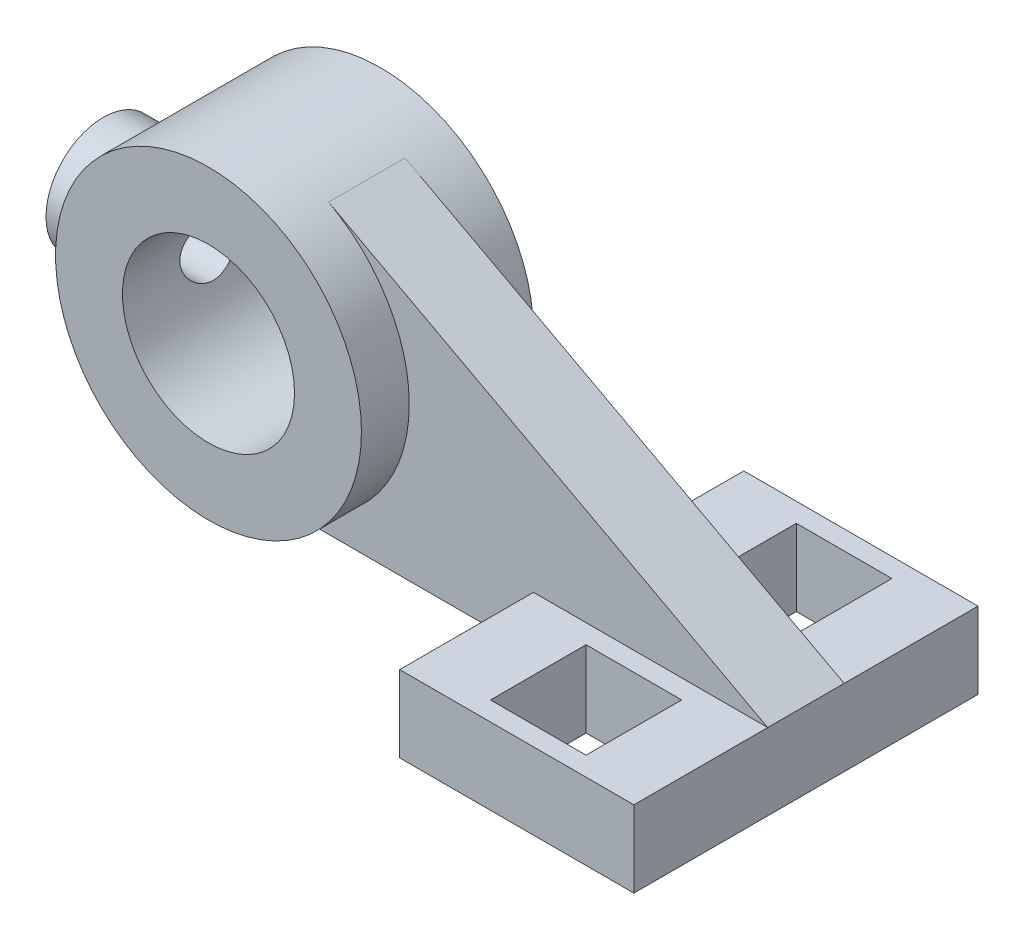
ISO-10303-21;
HEADER;
FILE_DESCRIPTION(('STEP AP214'),'2;1');
FILE_NAME('part.step','',(''),(''),'','','');
FILE_SCHEMA(('AUTOMOTIVE_DESIGN { 1 0 10303 214 1 1 1 1 }'));
ENDSEC;
DATA;
#1=APPLICATION_CONTEXT('core data for automotive mechanical design processes');
#2=APPLICATION_PROTOCOL_DEFINITION('international standard','automotive_design',2000,#1);
#3=PRODUCT_CONTEXT('',#1,'mechanical');
#4=PRODUCT('Part','Part','',(#3));
#5=PRODUCT_RELATED_PRODUCT_CATEGORY('part','',(#4));
#6=PRODUCT_DEFINITION_FORMATION('','',#4);
#7=PRODUCT_DEFINITION_CONTEXT('part definition',#1,'design');
#8=PRODUCT_DEFINITION('design','',#6,#7);
#9=PRODUCT_DEFINITION_SHAPE('','',#8);
#10=(LENGTH_UNIT() NAMED_UNIT(*) SI_UNIT(.MILLI.,.METRE.));
#11=(NAMED_UNIT(*) PLANE_ANGLE_UNIT() SI_UNIT($,.RADIAN.));
#12=(NAMED_UNIT(*) SI_UNIT($,.STERADIAN.) SOLID_ANGLE_UNIT());
#13=UNCERTAINTY_MEASURE_WITH_UNIT(LENGTH_MEASURE(1.E-05),#10,'distance_accuracy_value','');
#14=(GEOMETRIC_REPRESENTATION_CONTEXT(3) GLOBAL_UNCERTAINTY_ASSIGNED_CONTEXT((#13)) GLOBAL_UNIT_ASSIGNED_CONTEXT((#10,
#11,#12)) REPRESENTATION_CONTEXT('',''));
#15=CARTESIAN_POINT('',(0.,0.,0.));
#16=DIRECTION('',(0.,0.,1.));
#17=DIRECTION('',(1.,0.,0.));
#18=AXIS2_PLACEMENT_3D('',#15,#16,#17);
#19=CARTESIAN_POINT('',(0.,0.,-36.));
#20=DIRECTION('',(0.,0.,1.));
#21=DIRECTION('',(1.,0.,0.));
#22=AXIS2_PLACEMENT_3D('',#19,#20,#21);
#23=CYLINDRICAL_SURFACE('',#22,64.);
#24=DIRECTION('',(0.,0.,1.));
#25=VECTOR('',#24,1.);
#26=CARTESIAN_POINT('',(30.2468964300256,56.4014650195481,-16.));
#27=LINE('',#26,#25);
#28=CARTESIAN_POINT('',(30.2468964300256,56.4014650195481,-16.));
#29=VERTEX_POINT('',#28);
#30=CARTESIAN_POINT('',(30.2468964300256,56.4014650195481,16.));
#31=VERTEX_POINT('',#30);
#32=EDGE_CURVE('E286',#29,#31,#27,.T.);
#33=ORIENTED_EDGE('',*,*,#32,.F.);
#34=CARTESIAN_POINT('',(0.,0.,-16.));
#35=DIRECTION('',(0.,0.,1.));
#36=DIRECTION('',(1.,0.,0.));
#37=AXIS2_PLACEMENT_3D('',#34,#35,#36);
#38=CIRCLE('',#37,64.);
#39=CARTESIAN_POINT('',(0.,-64.,-16.));
#40=VERTEX_POINT('',#39);
#41=EDGE_CURVE('E273',#40,#29,#38,.T.);
#42=ORIENTED_EDGE('',*,*,#41,.F.);
#43=DIRECTION('',(0.,0.,1.));
#44=VECTOR('',#43,1.);
#45=CARTESIAN_POINT('',(0.,-64.,-16.));
#46=LINE('',#45,#44);
#47=CARTESIAN_POINT('',(0.,-64.,16.));
#48=VERTEX_POINT('',#47);
#49=EDGE_CURVE('E285',#40,#48,#46,.T.);
#50=ORIENTED_EDGE('',*,*,#49,.T.);
#51=CARTESIAN_POINT('',(0.,0.,16.));
#52=DIRECTION('',(0.,0.,1.));
#53=DIRECTION('',(1.,0.,0.));
#54=AXIS2_PLACEMENT_3D('',#51,#52,#53);
#55=CIRCLE('',#54,64.);
#56=EDGE_CURVE('E250',#48,#31,#55,.T.);
#57=ORIENTED_EDGE('',*,*,#56,.T.);
#58=EDGE_LOOP('',(#33,#42,#50,#57));
#59=FACE_BOUND('',#58,.T.);
#60=CARTESIAN_POINT('',(0.,0.,-36.));
#61=DIRECTION('',(0.,0.,1.));
#62=DIRECTION('',(1.,0.,0.));
#63=AXIS2_PLACEMENT_3D('',#60,#61,#62);
#64=CIRCLE('',#63,64.);
#65=CARTESIAN_POINT('',(64.,0.,-36.));
#66=VERTEX_POINT('',#65);
#67=EDGE_CURVE('E38',#66,#66,#64,.T.);
#68=ORIENTED_EDGE('',*,*,#67,.T.);
#69=EDGE_LOOP('',(#68));
#70=FACE_BOUND('',#69,.T.);
#71=CARTESIAN_POINT('',(0.,0.,36.));
#72=DIRECTION('',(0.,0.,1.));
#73=DIRECTION('',(1.,0.,0.));
#74=AXIS2_PLACEMENT_3D('',#71,#72,#73);
#75=CIRCLE('',#74,64.);
#76=CARTESIAN_POINT('',(64.,0.,36.));
#77=VERTEX_POINT('',#76);
#78=EDGE_CURVE('E289',#77,#77,#75,.T.);
#79=ORIENTED_EDGE('',*,*,#78,.F.);
#80=EDGE_LOOP('',(#79));
#81=FACE_BOUND('',#80,.T.);
#82=CARTESIAN_POINT('',(-64.,0.,24.));
#83=CARTESIAN_POINT('',(-64.0000022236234,0.64984837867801,24.0000030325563));
#84=CARTESIAN_POINT('',(-63.9900810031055,1.29965496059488,23.9735860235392));
#85=CARTESIAN_POINT('',(-63.9506736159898,2.59435422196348,23.8682021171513));
#86=CARTESIAN_POINT('',(-63.9211891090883,3.2392473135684,23.7892396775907));
#87=CARTESIAN_POINT('',(-63.8434575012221,4.51930130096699,23.5795783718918));
#88=CARTESIAN_POINT('',(-63.7952131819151,5.15446362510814,23.4488871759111));
#89=CARTESIAN_POINT('',(-63.6812460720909,6.41067087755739,23.1370298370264));
#90=CARTESIAN_POINT('',(-63.6155228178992,7.03171543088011,22.9558623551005));
#91=CARTESIAN_POINT('',(-63.4684606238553,8.25426356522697,22.5451139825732));
#92=CARTESIAN_POINT('',(-63.3871529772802,8.85580352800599,22.315630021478));
#93=CARTESIAN_POINT('',(-63.2109062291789,10.0368248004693,21.8099701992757));
#94=CARTESIAN_POINT('',(-63.1159672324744,10.6163062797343,21.5337946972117));
#95=CARTESIAN_POINT('',(-62.9147942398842,11.749899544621,20.9368167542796));
#96=CARTESIAN_POINT('',(-62.8085579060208,12.3040060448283,20.6160050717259));
#97=CARTESIAN_POINT('',(-62.5874011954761,13.3836065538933,19.9320720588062));
#98=CARTESIAN_POINT('',(-62.4724805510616,13.9090996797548,19.5689494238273));
#99=CARTESIAN_POINT('',(-62.2321872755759,14.9482428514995,18.7879843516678));
#100=CARTESIAN_POINT('',(-62.1065829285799,15.4606690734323,18.3685791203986));
#101=CARTESIAN_POINT('',(-61.9158652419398,16.2015667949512,17.7092802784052));
#102=CARTESIAN_POINT('',(-61.8519039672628,16.4439214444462,17.4844692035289));
#103=CARTESIAN_POINT('',(-61.7236005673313,16.9191521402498,17.0250268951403));
#104=CARTESIAN_POINT('',(-61.6592583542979,17.152025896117,16.7903933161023));
#105=CARTESIAN_POINT('',(-61.4662984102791,17.8358763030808,16.0722887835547));
#106=CARTESIAN_POINT('',(-61.3377437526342,18.27209601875,15.5746016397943));
#107=CARTESIAN_POINT('',(-61.0842731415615,19.1023575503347,14.5443329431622));
#108=CARTESIAN_POINT('',(-60.9593571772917,19.4963994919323,14.0117514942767));
#109=CARTESIAN_POINT('',(-60.7749758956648,20.0609950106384,13.1785755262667));
#110=CARTESIAN_POINT('',(-60.7129144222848,20.2479234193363,12.8895366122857));
#111=CARTESIAN_POINT('',(-60.5911823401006,20.6093416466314,12.3033967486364));
#112=CARTESIAN_POINT('',(-60.531511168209,20.7838344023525,12.0062977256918));
#113=CARTESIAN_POINT('',(-60.3567519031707,21.2882419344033,11.1034192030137));
#114=CARTESIAN_POINT('',(-60.2459078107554,21.5991170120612,10.4860124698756));
#115=CARTESIAN_POINT('',(-60.0392432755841,22.1671077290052,9.22483662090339));
#116=CARTESIAN_POINT('',(-59.9434181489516,22.4242401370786,8.5810758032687));
#117=CARTESIAN_POINT('',(-59.7700059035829,22.8824492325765,7.27149176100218));
#118=CARTESIAN_POINT('',(-59.6924177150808,23.0835292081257,6.60566983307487));
#119=CARTESIAN_POINT('',(-59.5610146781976,23.4204374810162,5.28474195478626));
#120=CARTESIAN_POINT('',(-59.5063556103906,23.5586029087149,4.63031574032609));
#121=CARTESIAN_POINT('',(-59.4182483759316,23.7799497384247,3.31080718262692));
#122=CARTESIAN_POINT('',(-59.3847996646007,23.8631325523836,2.64572511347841));
#123=CARTESIAN_POINT('',(-59.3403076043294,23.9735573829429,1.31042150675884));
#124=CARTESIAN_POINT('',(-59.3292562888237,24.0008192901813,0.640201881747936));
#125=CARTESIAN_POINT('',(-59.3299346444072,23.9991432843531,-0.70014224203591));
#126=CARTESIAN_POINT('',(-59.3416634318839,23.9702075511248,-1.37026674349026));
#127=CARTESIAN_POINT('',(-59.3860976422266,23.8598957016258,-2.66493143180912));
#128=CARTESIAN_POINT('',(-59.4175035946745,23.7817668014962,-3.28979632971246));
#129=CARTESIAN_POINT('',(-59.4990760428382,23.5769397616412,-4.53023644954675));
#130=CARTESIAN_POINT('',(-59.5492416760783,23.4502438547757,-5.1458120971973));
#131=CARTESIAN_POINT('',(-59.6668119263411,23.1494617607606,-6.36363778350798));
#132=CARTESIAN_POINT('',(-59.7342183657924,22.975370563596,-6.96588640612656));
#133=CARTESIAN_POINT('',(-59.8842902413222,22.5813237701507,-8.15322737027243));
#134=CARTESIAN_POINT('',(-59.966956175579,22.361366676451,-8.73831915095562));
#135=CARTESIAN_POINT('',(-60.1469084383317,21.8727779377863,-9.89875651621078));
#136=CARTESIAN_POINT('',(-60.2444412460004,21.603306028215,-10.4737097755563));
#137=CARTESIAN_POINT('',(-60.450227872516,21.0205939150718,-11.5989691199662));
#138=CARTESIAN_POINT('',(-60.558481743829,20.7073534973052,-12.149275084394));
#139=CARTESIAN_POINT('',(-60.7828686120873,20.0391395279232,-13.2224277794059));
#140=CARTESIAN_POINT('',(-60.8990038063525,19.6841543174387,-13.7452667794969));
#141=CARTESIAN_POINT('',(-61.1361960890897,18.9346233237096,-14.7606977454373));
#142=CARTESIAN_POINT('',(-61.2572533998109,18.5400757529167,-15.2532883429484));
#143=CARTESIAN_POINT('',(-61.444380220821,17.9064521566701,-15.9834987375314));
#144=CARTESIAN_POINT('',(-61.5097744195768,17.6806462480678,-16.2329260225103));
#145=CARTESIAN_POINT('',(-61.6406504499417,17.218821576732,-16.7219999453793));
#146=CARTESIAN_POINT('',(-61.7061322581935,16.9828051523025,-16.9616487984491));
#147=CARTESIAN_POINT('',(-61.9020789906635,16.2598224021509,-17.665518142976));
#148=CARTESIAN_POINT('',(-62.0320525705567,15.7578979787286,-18.1146897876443));
#149=CARTESIAN_POINT('',(-62.2871410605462,14.7173066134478,-18.9698340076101));
#150=CARTESIAN_POINT('',(-62.4122551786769,14.1786337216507,-19.3757995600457));
#151=CARTESIAN_POINT('',(-62.6542679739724,13.0677382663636,-20.1417308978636));
#152=CARTESIAN_POINT('',(-62.771166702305,12.4955159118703,-20.5016969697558));
#153=CARTESIAN_POINT('',(-62.9953108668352,11.3119031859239,-21.1781171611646));
#154=CARTESIAN_POINT('',(-63.1023780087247,10.7000422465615,-21.4938079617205));
#155=CARTESIAN_POINT('',(-63.3017326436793,9.44941953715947,-22.0722245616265));
#156=CARTESIAN_POINT('',(-63.3940198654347,8.81065727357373,-22.3349493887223));
#157=CARTESIAN_POINT('',(-63.5610990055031,7.51103971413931,-22.8048579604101));
#158=CARTESIAN_POINT('',(-63.6358972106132,6.85019245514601,-23.0120616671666));
#159=CARTESIAN_POINT('',(-63.7658089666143,5.51125014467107,-23.3689121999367));
#160=CARTESIAN_POINT('',(-63.8209236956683,4.83315612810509,-23.5185624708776));
#161=CARTESIAN_POINT('',(-63.9074336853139,3.5015928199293,-23.7522881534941));
#162=CARTESIAN_POINT('',(-63.9399345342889,2.84873186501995,-23.8394277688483));
#163=CARTESIAN_POINT('',(-63.9848951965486,1.53737555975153,-23.9597569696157));
#164=CARTESIAN_POINT('',(-63.9973557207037,0.878880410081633,-23.9929484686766));
#165=CARTESIAN_POINT('',(-64.0018868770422,-0.438545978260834,-24.005031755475));
#166=CARTESIAN_POINT('',(-63.9939614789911,-1.09747710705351,-23.9839341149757));
#167=CARTESIAN_POINT('',(-63.9579509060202,-2.4108155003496,-23.8876846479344));
#168=CARTESIAN_POINT('',(-63.9298660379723,-3.06522283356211,-23.8125336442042));
#169=CARTESIAN_POINT('',(-63.8557768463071,-4.33951159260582,-23.6128872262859));
#170=CARTESIAN_POINT('',(-63.8105040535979,-4.95975226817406,-23.4904029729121));
#171=CARTESIAN_POINT('',(-63.703198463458,-6.1872504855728,-23.1973291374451));
#172=CARTESIAN_POINT('',(-63.6411662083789,-6.79450844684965,-23.0267411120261));
#173=CARTESIAN_POINT('',(-63.501877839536,-7.99218660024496,-22.6389314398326));
#174=CARTESIAN_POINT('',(-63.4246204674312,-8.58260539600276,-22.4217059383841));
#175=CARTESIAN_POINT('',(-63.2567635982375,-9.74297593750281,-21.9423906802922));
#176=CARTESIAN_POINT('',(-63.166163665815,-10.3129270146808,-21.6802994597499));
#177=CARTESIAN_POINT('',(-62.9709524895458,-11.4454783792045,-21.10488644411));
#178=CARTESIAN_POINT('',(-62.8660080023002,-12.0073716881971,-20.7902865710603));
#179=CARTESIAN_POINT('',(-62.6468597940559,-13.1027859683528,-20.11790310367));
#180=CARTESIAN_POINT('',(-62.5326559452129,-13.6363065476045,-19.7601189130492));
#181=CARTESIAN_POINT('',(-62.2977417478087,-14.6722047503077,-19.0036294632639));
#182=CARTESIAN_POINT('',(-62.1770293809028,-15.1745726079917,-18.6049114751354));
#183=CARTESIAN_POINT('',(-61.9320377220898,-16.1453805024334,-17.7689876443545));
#184=CARTESIAN_POINT('',(-61.8077583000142,-16.6138192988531,-17.3317803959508));
#185=CARTESIAN_POINT('',(-61.6173494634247,-17.3021209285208,-16.6358470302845));
#186=CARTESIAN_POINT('',(-61.5513891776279,-17.5351849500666,-16.3899973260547));
#187=CARTESIAN_POINT('',(-61.4197961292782,-17.9906870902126,-15.8886707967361));
#188=CARTESIAN_POINT('',(-61.3541632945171,-18.2131276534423,-15.6331962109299));
#189=CARTESIAN_POINT('',(-61.1584051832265,-18.8641140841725,-14.8527473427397));
#190=CARTESIAN_POINT('',(-61.0294123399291,-19.2763531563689,-14.3137191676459));
#191=CARTESIAN_POINT('',(-60.7781975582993,-20.0543749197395,-13.2016189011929));
#192=CARTESIAN_POINT('',(-60.6559764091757,-20.4201522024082,-12.6285428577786));
#193=CARTESIAN_POINT('',(-60.4219419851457,-21.1025846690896,-11.4517877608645));
#194=CARTESIAN_POINT('',(-60.3101285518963,-21.4192406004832,-10.8481091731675));
#195=CARTESIAN_POINT('',(-60.0999638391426,-22.0020635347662,-9.61137164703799));
#196=CARTESIAN_POINT('',(-60.0016715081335,-22.2680112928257,-8.97819922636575));
#197=CARTESIAN_POINT('',(-59.8223729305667,-22.7453020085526,-7.68918286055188));
#198=CARTESIAN_POINT('',(-59.7413668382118,-22.956644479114,-7.03333871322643));
#199=CARTESIAN_POINT('',(-59.5995089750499,-23.3224583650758,-5.70419009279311));
#200=CARTESIAN_POINT('',(-59.5386467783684,-23.4769592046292,-5.03089484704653));
#201=CARTESIAN_POINT('',(-59.439244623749,-23.7275041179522,-3.67190024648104));
#202=CARTESIAN_POINT('',(-59.4007031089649,-23.8235522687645,-2.98620176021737));
#203=CARTESIAN_POINT('',(-59.349098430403,-23.9518039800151,-1.6524731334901));
#204=CARTESIAN_POINT('',(-59.3345571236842,-23.9877137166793,-1.00485404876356));
#205=CARTESIAN_POINT('',(-59.3267642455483,-24.006981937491,0.291279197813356));
#206=CARTESIAN_POINT('',(-59.3335117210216,-23.990342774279,0.9397933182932));
#207=CARTESIAN_POINT('',(-59.3680671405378,-23.904700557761,2.23271739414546));
#208=CARTESIAN_POINT('',(-59.3958731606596,-23.8357022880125,2.87712771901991));
#209=CARTESIAN_POINT('',(-59.471617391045,-23.6460804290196,4.15709647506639));
#210=CARTESIAN_POINT('',(-59.5195555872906,-23.5254568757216,4.79265491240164));
#211=CARTESIAN_POINT('',(-59.6322523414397,-23.2382758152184,6.03110100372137));
#212=CARTESIAN_POINT('',(-59.6964511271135,-23.0732373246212,6.63439321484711));
#213=CARTESIAN_POINT('',(-59.8404101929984,-22.697263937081,7.82455606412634));
#214=CARTESIAN_POINT('',(-59.9201700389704,-22.4863303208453,8.41142715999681));
#215=CARTESIAN_POINT('',(-60.0930239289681,-22.0202228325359,9.56541145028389));
#216=CARTESIAN_POINT('',(-60.1861204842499,-21.7650406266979,10.1325208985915));
#217=CARTESIAN_POINT('',(-60.3831318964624,-21.2123415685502,11.2437420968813));
#218=CARTESIAN_POINT('',(-60.4870472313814,-20.9148228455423,11.7878528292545));
#219=CARTESIAN_POINT('',(-60.7087125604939,-20.2626966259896,12.8781750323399));
#220=CARTESIAN_POINT('',(-60.8269022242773,-19.9059140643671,13.4230014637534));
#221=CARTESIAN_POINT('',(-61.0085171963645,-19.3390847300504,14.2163823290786));
#222=CARTESIAN_POINT('',(-61.0697809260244,-19.1448535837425,14.4768804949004));
#223=CARTESIAN_POINT('',(-61.1933720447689,-18.7460612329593,14.9896865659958));
#224=CARTESIAN_POINT('',(-61.2556996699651,-18.5414977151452,15.2419926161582));
#225=CARTESIAN_POINT('',(-61.4436640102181,-17.9127741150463,15.9860624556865));
#226=CARTESIAN_POINT('',(-61.5702859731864,-17.4735692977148,16.4649942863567));
#227=CARTESIAN_POINT('',(-61.8228826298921,-16.5576801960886,17.3857672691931));
#228=CARTESIAN_POINT('',(-61.9488573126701,-16.080995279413,17.8276077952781));
#229=CARTESIAN_POINT('',(-62.1383171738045,-15.3265039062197,18.4720237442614));
#230=CARTESIAN_POINT('',(-62.2031917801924,-15.0612046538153,18.6889697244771));
#231=CARTESIAN_POINT('',(-62.3314196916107,-14.5214008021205,19.1114198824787));
#232=CARTESIAN_POINT('',(-62.3947733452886,-14.2468983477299,19.3169266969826));
#233=CARTESIAN_POINT('',(-62.5819237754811,-13.4100462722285,19.9158515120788));
#234=CARTESIAN_POINT('',(-62.7028207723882,-12.8343095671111,20.2917100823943));
#235=CARTESIAN_POINT('',(-62.9334333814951,-11.651025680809,20.9934974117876));
#236=CARTESIAN_POINT('',(-63.0431477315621,-11.0434749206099,21.3194205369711));
#237=CARTESIAN_POINT('',(-63.2482858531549,-9.80056027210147,21.9185974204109));
#238=CARTESIAN_POINT('',(-63.3437093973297,-9.16519594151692,22.1918503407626));
#239=CARTESIAN_POINT('',(-63.5212618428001,-7.84303336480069,22.6937936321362));
#240=CARTESIAN_POINT('',(-63.602633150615,-7.15519978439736,22.9200325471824));
#241=CARTESIAN_POINT('',(-63.7441475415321,-5.75980882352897,23.3098555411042));
#242=CARTESIAN_POINT('',(-63.8042895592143,-5.05225045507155,23.4734364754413));
#243=CARTESIAN_POINT('',(-63.9013225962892,-3.6239597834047,23.73592039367));
#244=CARTESIAN_POINT('',(-63.9382233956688,-2.90323315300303,23.834850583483));
#245=CARTESIAN_POINT('',(-63.9875594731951,-1.45498637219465,23.9668849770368));
#246=CARTESIAN_POINT('',(-63.9999975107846,-0.727466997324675,23.9999966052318));
#247=CARTESIAN_POINT('',(-64.,0.,24.));
#248=B_SPLINE_CURVE_WITH_KNOTS('',3,(#82,#83,#84,#85,#86,#87,#88,#89,#90,#91,#92,#93,#94,#95,
#96,#97,#98,#99,#100,#101,#102,#103,#104,#105,#106,#107,#108,#109,#110,#111,#112,#113,#114,#115,
#116,#117,#118,#119,#120,#121,#122,#123,#124,#125,#126,#127,#128,#129,#130,#131,#132,#133,#134,
#135,#136,#137,#138,#139,#140,#141,#142,#143,#144,#145,#146,#147,#148,#149,#150,#151,#152,#153,
#154,#155,#156,#157,#158,#159,#160,#161,#162,#163,#164,#165,#166,#167,#168,#169,#170,#171,#172,
#173,#174,#175,#176,#177,#178,#179,#180,#181,#182,#183,#184,#185,#186,#187,#188,#189,#190,#191,
#192,#193,#194,#195,#196,#197,#198,#199,#200,#201,#202,#203,#204,#205,#206,#207,#208,#209,#210,
#211,#212,#213,#214,#215,#216,#217,#218,#219,#220,#221,#222,#223,#224,#225,#226,#227,#228,#229,
#230,#231,#232,#233,#234,#235,#236,#237,#238,#239,#240,#241,#242,#243,#244,#245,#246,#247),
.UNSPECIFIED.,.T.,.F.,(4,2,2,2,2,2,2,2,2,2,2,2,2,2,2,2,2,2,2,2,2,2,2,2,2,2,2,2,2,2,2,2,2,2,2,2,
2,2,2,2,2,2,2,2,2,2,2,2,2,2,2,2,2,2,2,2,2,2,2,2,2,2,2,2,2,2,2,2,2,2,2,2,2,2,2,2,2,2,2,2,2,2,4),
(0.,1.9488636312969,3.89756194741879,5.84597142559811,7.79443259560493,9.73902150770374,
11.6835954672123,13.6285726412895,15.5736098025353,17.5931192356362,18.6029830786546,
19.6130894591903,21.6332454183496,23.6533953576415,24.7024101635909,25.7511763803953,
27.8485406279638,29.9452494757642,32.0418353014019,34.0524685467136,36.0630501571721,
38.0729164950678,40.0827048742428,41.9720272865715,43.8612628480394,45.7506981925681,
47.6401952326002,49.5653516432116,51.4905174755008,53.4162222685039,55.3420141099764,
56.3700106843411,57.3977730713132,59.4531833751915,61.5089272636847,63.5646583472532,
65.6523435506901,67.7400670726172,69.8270389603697,71.9138859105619,73.8897475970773,
75.8655391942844,77.8409460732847,79.8163228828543,81.7156473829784,83.6149104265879,
85.5143305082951,87.4138125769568,89.3690567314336,91.3243278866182,93.2802089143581,
95.2361614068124,96.2712750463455,97.3061493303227,99.3757745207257,101.445640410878,
103.515474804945,105.594065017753,107.672673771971,109.75020501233,111.827591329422,
113.771479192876,115.715280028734,117.658903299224,119.602525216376,121.486654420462,
123.370731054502,125.255162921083,127.139678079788,129.122980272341,130.114745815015,
131.106734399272,133.090650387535,135.0745998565,136.120704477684,137.166566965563,
139.258122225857,141.34991328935,143.441737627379,145.624431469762,147.807234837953,
149.989119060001,152.170757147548),.UNSPECIFIED.);
#249=CARTESIAN_POINT('',(-64.,0.,24.));
#250=VERTEX_POINT('',#249);
#251=EDGE_CURVE('E171',#250,#250,#248,.T.);
#252=ORIENTED_EDGE('',*,*,#251,.F.);
#253=EDGE_LOOP('',(#252));
#254=FACE_BOUND('',#253,.T.);
#255=ADVANCED_FACE('F31',(#59,#70,#81,#254),#23,.T.);
#256=CARTESIAN_POINT('',(75.,-42.141384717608,-72.));
#257=DIRECTION('',(0.,1.,0.));
#258=DIRECTION('',(-1.,0.,0.));
#259=AXIS2_PLACEMENT_3D('',#256,#257,#258);
#260=PLANE('',#259);
#261=DIRECTION('',(-1.,0.,0.));
#262=VECTOR('',#261,1.);
#263=CARTESIAN_POINT('',(75.,-42.141384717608,-16.));
#264=LINE('',#263,#262);
#265=CARTESIAN_POINT('',(214.,-42.141384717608,-16.));
#266=VERTEX_POINT('',#265);
#267=CARTESIAN_POINT('',(116.,-42.141384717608,-16.));
#268=VERTEX_POINT('',#267);
#269=EDGE_CURVE('E281',#266,#268,#264,.T.);
#270=ORIENTED_EDGE('',*,*,#269,.F.);
#271=DIRECTION('',(0.,0.,1.));
#272=VECTOR('',#271,1.);
#273=CARTESIAN_POINT('',(214.,-42.141384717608,-72.));
#274=LINE('',#273,#272);
#275=CARTESIAN_POINT('',(214.,-42.141384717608,-72.));
#276=VERTEX_POINT('',#275);
#277=EDGE_CURVE('E255',#276,#266,#274,.T.);
#278=ORIENTED_EDGE('',*,*,#277,.F.);
#279=DIRECTION('',(-1.,0.,0.));
#280=VECTOR('',#279,1.);
#281=CARTESIAN_POINT('',(75.,-42.141384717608,-72.));
#282=LINE('',#281,#280);
#283=CARTESIAN_POINT('',(116.,-42.141384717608,-72.));
#284=VERTEX_POINT('',#283);
#285=EDGE_CURVE('E241',#276,#284,#282,.T.);
#286=ORIENTED_EDGE('',*,*,#285,.T.);
#287=DIRECTION('',(0.,0.,1.));
#288=VECTOR('',#287,1.);
#289=CARTESIAN_POINT('',(116.,-42.141384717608,-72.));
#290=LINE('',#289,#288);
#291=EDGE_CURVE('E251',#284,#268,#290,.T.);
#292=ORIENTED_EDGE('',*,*,#291,.T.);
#293=EDGE_LOOP('',(#270,#278,#286,#292));
#294=FACE_BOUND('',#293,.T.);
#295=DIRECTION('',(-1.,0.,0.));
#296=VECTOR('',#295,1.);
#297=CARTESIAN_POINT('',(146.,-42.141384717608,-24.));
#298=LINE('',#297,#296);
#299=CARTESIAN_POINT('',(186.,-42.141384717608,-24.));
#300=VERTEX_POINT('',#299);
#301=CARTESIAN_POINT('',(146.,-42.141384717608,-24.));
#302=VERTEX_POINT('',#301);
#303=EDGE_CURVE('E181',#300,#302,#298,.T.);
#304=ORIENTED_EDGE('',*,*,#303,.T.);
#305=DIRECTION('',(0.,0.,-1.));
#306=VECTOR('',#305,1.);
#307=CARTESIAN_POINT('',(146.,-42.141384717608,-24.));
#308=LINE('',#307,#306);
#309=CARTESIAN_POINT('',(146.,-42.141384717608,-64.));
#310=VERTEX_POINT('',#309);
#311=EDGE_CURVE('E45',#302,#310,#308,.T.);
#312=ORIENTED_EDGE('',*,*,#311,.T.);
#313=DIRECTION('',(1.,0.,0.));
#314=VECTOR('',#313,1.);
#315=CARTESIAN_POINT('',(146.,-42.141384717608,-64.));
#316=LINE('',#315,#314);
#317=CARTESIAN_POINT('',(186.,-42.141384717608,-64.));
#318=VERTEX_POINT('',#317);
#319=EDGE_CURVE('E165',#310,#318,#316,.T.);
#320=ORIENTED_EDGE('',*,*,#319,.T.);
#321=DIRECTION('',(0.,0.,1.));
#322=VECTOR('',#321,1.);
#323=CARTESIAN_POINT('',(186.,-42.141384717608,-24.));
#324=LINE('',#323,#322);
#325=EDGE_CURVE('E168',#318,#300,#324,.T.);
#326=ORIENTED_EDGE('',*,*,#325,.T.);
#327=EDGE_LOOP('',(#304,#312,#320,#326));
#328=FACE_BOUND('',#327,.T.);
#329=ADVANCED_FACE('F330',(#294,#328),#260,.T.);
#330=CARTESIAN_POINT('',(75.,-74.141384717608,-72.));
#331=DIRECTION('',(0.,-1.,0.));
#332=DIRECTION('',(0.,0.,-1.));
#333=AXIS2_PLACEMENT_3D('',#330,#331,#332);
#334=PLANE('',#333);
#335=DIRECTION('',(0.,0.,1.));
#336=VECTOR('',#335,1.);
#337=CARTESIAN_POINT('',(214.,-74.141384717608,-72.));
#338=LINE('',#337,#336);
#339=CARTESIAN_POINT('',(214.,-74.141384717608,-72.));
#340=VERTEX_POINT('',#339);
#341=CARTESIAN_POINT('',(214.,-74.141384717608,72.));
#342=VERTEX_POINT('',#341);
#343=EDGE_CURVE('E247',#340,#342,#338,.T.);
#344=ORIENTED_EDGE('',*,*,#343,.T.);
#345=DIRECTION('',(1.,0.,0.));
#346=VECTOR('',#345,1.);
#347=CARTESIAN_POINT('',(75.,-74.141384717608,72.));
#348=LINE('',#347,#346);
#349=CARTESIAN_POINT('',(116.,-74.141384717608,72.));
#350=VERTEX_POINT('',#349);
#351=EDGE_CURVE('E217',#350,#342,#348,.T.);
#352=ORIENTED_EDGE('',*,*,#351,.F.);
#353=DIRECTION('',(0.,0.,1.));
#354=VECTOR('',#353,1.);
#355=CARTESIAN_POINT('',(116.,-74.141384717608,-72.));
#356=LINE('',#355,#354);
#357=CARTESIAN_POINT('',(116.,-74.141384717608,-72.));
#358=VERTEX_POINT('',#357);
#359=EDGE_CURVE('E248',#358,#350,#356,.T.);
#360=ORIENTED_EDGE('',*,*,#359,.F.);
#361=DIRECTION('',(1.,0.,0.));
#362=VECTOR('',#361,1.);
#363=CARTESIAN_POINT('',(75.,-74.141384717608,-72.));
#364=LINE('',#363,#362);
#365=EDGE_CURVE('E235',#358,#340,#364,.T.);
#366=ORIENTED_EDGE('',*,*,#365,.T.);
#367=EDGE_LOOP('',(#344,#352,#360,#366));
#368=FACE_BOUND('',#367,.T.);
#369=DIRECTION('',(0.,0.,1.));
#370=VECTOR('',#369,1.);
#371=CARTESIAN_POINT('',(146.,-74.141384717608,24.));
#372=LINE('',#371,#370);
#373=CARTESIAN_POINT('',(146.,-74.141384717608,24.));
#374=VERTEX_POINT('',#373);
#375=CARTESIAN_POINT('',(146.,-74.141384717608,64.));
#376=VERTEX_POINT('',#375);
#377=EDGE_CURVE('E192',#374,#376,#372,.T.);
#378=ORIENTED_EDGE('',*,*,#377,.T.);
#379=DIRECTION('',(1.,0.,0.));
#380=VECTOR('',#379,1.);
#381=CARTESIAN_POINT('',(146.,-74.141384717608,64.));
#382=LINE('',#381,#380);
#383=CARTESIAN_POINT('',(186.,-74.141384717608,64.));
#384=VERTEX_POINT('',#383);
#385=EDGE_CURVE('E195',#376,#384,#382,.T.);
#386=ORIENTED_EDGE('',*,*,#385,.T.);
#387=DIRECTION('',(0.,0.,-1.));
#388=VECTOR('',#387,1.);
#389=CARTESIAN_POINT('',(186.,-74.141384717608,24.));
#390=LINE('',#389,#388);
#391=CARTESIAN_POINT('',(186.,-74.141384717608,24.));
#392=VERTEX_POINT('',#391);
#393=EDGE_CURVE('E199',#384,#392,#390,.T.);
#394=ORIENTED_EDGE('',*,*,#393,.T.);
#395=DIRECTION('',(-1.,0.,0.));
#396=VECTOR('',#395,1.);
#397=CARTESIAN_POINT('',(146.,-74.141384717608,24.));
#398=LINE('',#397,#396);
#399=EDGE_CURVE('E202',#392,#374,#398,.T.);
#400=ORIENTED_EDGE('',*,*,#399,.T.);
#401=EDGE_LOOP('',(#378,#386,#394,#400));
#402=FACE_BOUND('',#401,.T.);
#403=DIRECTION('',(1.,0.,0.));
#404=VECTOR('',#403,1.);
#405=CARTESIAN_POINT('',(146.,-74.141384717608,-64.));
#406=LINE('',#405,#404);
#407=CARTESIAN_POINT('',(146.,-74.141384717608,-64.));
#408=VERTEX_POINT('',#407);
#409=CARTESIAN_POINT('',(186.,-74.141384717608,-64.));
#410=VERTEX_POINT('',#409);
#411=EDGE_CURVE('E161',#408,#410,#406,.T.);
#412=ORIENTED_EDGE('',*,*,#411,.F.);
#413=DIRECTION('',(0.,0.,-1.));
#414=VECTOR('',#413,1.);
#415=CARTESIAN_POINT('',(146.,-74.141384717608,-24.));
#416=LINE('',#415,#414);
#417=CARTESIAN_POINT('',(146.,-74.141384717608,-24.));
#418=VERTEX_POINT('',#417);
#419=EDGE_CURVE('E157',#418,#408,#416,.T.);
#420=ORIENTED_EDGE('',*,*,#419,.F.);
#421=DIRECTION('',(-1.,0.,0.));
#422=VECTOR('',#421,1.);
#423=CARTESIAN_POINT('',(146.,-74.141384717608,-24.));
#424=LINE('',#423,#422);
#425=CARTESIAN_POINT('',(186.,-74.141384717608,-24.));
#426=VERTEX_POINT('',#425);
#427=EDGE_CURVE('E149',#426,#418,#424,.T.);
#428=ORIENTED_EDGE('',*,*,#427,.F.);
#429=DIRECTION('',(0.,0.,1.));
#430=VECTOR('',#429,1.);
#431=CARTESIAN_POINT('',(186.,-74.141384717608,-24.));
#432=LINE('',#431,#430);
#433=EDGE_CURVE('E156',#410,#426,#432,.T.);
#434=ORIENTED_EDGE('',*,*,#433,.F.);
#435=EDGE_LOOP('',(#412,#420,#428,#434));
#436=FACE_BOUND('',#435,.T.);
#437=ADVANCED_FACE('F164',(#368,#402,#436),#334,.T.);
#438=CARTESIAN_POINT('',(0.,0.,-36.));
#439=DIRECTION('',(0.,0.,1.));
#440=DIRECTION('',(1.,0.,0.));
#441=AXIS2_PLACEMENT_3D('',#438,#439,#440);
#442=CYLINDRICAL_SURFACE('',#441,36.);
#443=CARTESIAN_POINT('',(-36.,0.,12.));
#444=CARTESIAN_POINT('',(-36.0000000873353,-0.327380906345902,12.0000001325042));
#445=CARTESIAN_POINT('',(-35.9955240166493,-0.654759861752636,11.9865919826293));
#446=CARTESIAN_POINT('',(-35.9777430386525,-1.30708350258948,11.9330896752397));
#447=CARTESIAN_POINT('',(-35.964438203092,-1.63202820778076,11.8929957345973));
#448=CARTESIAN_POINT('',(-35.9293616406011,-2.27713334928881,11.7864986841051));
#449=CARTESIAN_POINT('',(-35.9075892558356,-2.59729341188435,11.7200935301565));
#450=CARTESIAN_POINT('',(-35.856165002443,-3.23053420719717,11.5615822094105));
#451=CARTESIAN_POINT('',(-35.8265130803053,-3.54361489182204,11.4694758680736));
#452=CARTESIAN_POINT('',(-35.7601741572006,-4.16003428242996,11.2605437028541));
#453=CARTESIAN_POINT('',(-35.72349930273,-4.46338876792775,11.1437605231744));
#454=CARTESIAN_POINT('',(-35.6440350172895,-5.05895574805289,10.8863315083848));
#455=CARTESIAN_POINT('',(-35.6012456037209,-5.35116827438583,10.7456857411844));
#456=CARTESIAN_POINT('',(-35.5106458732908,-5.92264610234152,10.4416007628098));
#457=CARTESIAN_POINT('',(-35.4628357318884,-6.20191185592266,10.2781623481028));
#458=CARTESIAN_POINT('',(-35.3633770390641,-6.74596768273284,9.92956922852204));
#459=CARTESIAN_POINT('',(-35.3117270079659,-7.01075210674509,9.74440613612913));
#460=CARTESIAN_POINT('',(-35.204260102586,-7.53213713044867,9.34759405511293));
#461=CARTESIAN_POINT('',(-35.1483638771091,-7.78823424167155,9.13530480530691));
#462=CARTESIAN_POINT('',(-35.0353296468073,-8.28189840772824,8.69026213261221));
#463=CARTESIAN_POINT('',(-34.9781910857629,-8.51945693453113,8.45749939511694));
#464=CARTESIAN_POINT('',(-34.8642061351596,-8.97452918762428,7.97297380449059));
#465=CARTESIAN_POINT('',(-34.8073598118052,-9.19203854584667,7.72120683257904));
#466=CARTESIAN_POINT('',(-34.6955377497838,-9.60549401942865,7.2003470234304));
#467=CARTESIAN_POINT('',(-34.6405611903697,-9.80144968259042,6.93126194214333));
#468=CARTESIAN_POINT('',(-34.532417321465,-10.1760145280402,6.36915226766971));
#469=CARTESIAN_POINT('',(-34.4793501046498,-10.3539478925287,6.07565744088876));
#470=CARTESIAN_POINT('',(-34.3784229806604,-10.6842812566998,5.47392758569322));
#471=CARTESIAN_POINT('',(-34.3305609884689,-10.8366914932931,5.16569853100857));
#472=CARTESIAN_POINT('',(-34.2415343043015,-11.1147947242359,4.53647920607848));
#473=CARTESIAN_POINT('',(-34.2003694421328,-11.2404883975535,4.2154892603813));
#474=CARTESIAN_POINT('',(-34.12609390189,-11.4640135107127,3.5630448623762));
#475=CARTESIAN_POINT('',(-34.0929828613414,-11.5618462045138,3.23159088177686));
#476=CARTESIAN_POINT('',(-34.0369075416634,-11.7258767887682,2.57203670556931));
#477=CARTESIAN_POINT('',(-34.013638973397,-11.7930294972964,2.24419978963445));
#478=CARTESIAN_POINT('',(-33.9764455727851,-11.8997627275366,1.58354061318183));
#479=CARTESIAN_POINT('',(-33.9625205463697,-11.9393438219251,1.25071845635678));
#480=CARTESIAN_POINT('',(-33.9444865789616,-11.9905200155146,0.582752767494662));
#481=CARTESIAN_POINT('',(-33.9403750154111,-12.0021225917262,0.247609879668));
#482=CARTESIAN_POINT('',(-33.942101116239,-11.9972406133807,-0.422440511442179));
#483=CARTESIAN_POINT('',(-33.9479384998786,-11.9807568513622,-0.757348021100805));
#484=CARTESIAN_POINT('',(-33.9688702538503,-11.9212742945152,-1.40901773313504));
#485=CARTESIAN_POINT('',(-33.9835287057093,-11.8795236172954,-1.72590885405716));
#486=CARTESIAN_POINT('',(-34.0212698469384,-11.7710022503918,-2.35485408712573));
#487=CARTESIAN_POINT('',(-34.0443522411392,-11.7042324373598,-2.66690836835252));
#488=CARTESIAN_POINT('',(-34.0982523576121,-11.5462608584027,-3.28410511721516));
#489=CARTESIAN_POINT('',(-34.129070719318,-11.4550570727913,-3.58924701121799));
#490=CARTESIAN_POINT('',(-34.1975465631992,-11.2489815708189,-4.19063918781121));
#491=CARTESIAN_POINT('',(-34.2352042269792,-11.1341092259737,-4.48688923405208));
#492=CARTESIAN_POINT('',(-34.3169468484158,-10.8795816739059,-5.07331151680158));
#493=CARTESIAN_POINT('',(-34.3611243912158,-10.7395618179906,-5.36331248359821));
#494=CARTESIAN_POINT('',(-34.4542334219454,-10.4369943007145,-5.93064479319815));
#495=CARTESIAN_POINT('',(-34.5031666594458,-10.2744383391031,-6.20797141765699));
#496=CARTESIAN_POINT('',(-34.6044509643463,-9.92796712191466,-6.748216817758));
#497=CARTESIAN_POINT('',(-34.6568014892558,-9.74405525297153,-7.011137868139));
#498=CARTESIAN_POINT('',(-34.7635909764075,-9.35592144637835,-7.52127040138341));
#499=CARTESIAN_POINT('',(-34.8180308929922,-9.1516901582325,-7.76847456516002));
#500=CARTESIAN_POINT('',(-34.9304644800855,-8.71301035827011,-8.25815187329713));
#501=CARTESIAN_POINT('',(-34.988495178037,-8.47754042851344,-8.49970248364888));
#502=CARTESIAN_POINT('',(-35.1036973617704,-7.98710487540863,-8.96212602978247));
#503=CARTESIAN_POINT('',(-35.1608691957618,-7.73214742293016,-9.18300754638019));
#504=CARTESIAN_POINT('',(-35.2728530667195,-7.20407593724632,-9.60287097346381));
#505=CARTESIAN_POINT('',(-35.3276638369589,-6.93095235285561,-9.80184121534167));
#506=CARTESIAN_POINT('',(-35.4333782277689,-6.36848094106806,-10.1762736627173));
#507=CARTESIAN_POINT('',(-35.4842834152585,-6.07913970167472,-10.3517453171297));
#508=CARTESIAN_POINT('',(-35.5813055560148,-5.48295669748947,-10.6796107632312));
#509=CARTESIAN_POINT('',(-35.6273684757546,-5.17596673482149,-10.8317513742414));
#510=CARTESIAN_POINT('',(-35.7127965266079,-4.54930228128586,-11.1095143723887));
#511=CARTESIAN_POINT('',(-35.7521615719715,-4.22962762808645,-11.2351364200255));
#512=CARTESIAN_POINT('',(-35.8230431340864,-3.57998641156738,-11.4586937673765));
#513=CARTESIAN_POINT('',(-35.8545618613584,-3.2500227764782,-11.5566368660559));
#514=CARTESIAN_POINT('',(-35.9088335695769,-2.58222175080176,-11.7239327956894));
#515=CARTESIAN_POINT('',(-35.9315869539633,-2.24438472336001,-11.793286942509));
#516=CARTESIAN_POINT('',(-35.9668655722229,-1.57827683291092,-11.9003299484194));
#517=CARTESIAN_POINT('',(-35.9797915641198,-1.25022644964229,-11.9392615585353));
#518=CARTESIAN_POINT('',(-35.9966415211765,-0.591805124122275,-11.989944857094));
#519=CARTESIAN_POINT('',(-36.0005657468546,-0.261434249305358,-12.001697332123));
#520=CARTESIAN_POINT('',(-35.9993026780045,0.39908163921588,-11.9979079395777));
#521=CARTESIAN_POINT('',(-35.9941167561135,0.729226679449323,-11.9823701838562));
#522=CARTESIAN_POINT('',(-35.9747809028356,1.38684745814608,-11.9241609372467));
#523=CARTESIAN_POINT('',(-35.9606310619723,1.71432322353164,-11.8814897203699));
#524=CARTESIAN_POINT('',(-35.9242969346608,2.35473254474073,-11.7710550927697));
#525=CARTESIAN_POINT('',(-35.9023577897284,2.66781229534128,-11.7040559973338));
#526=CARTESIAN_POINT('',(-35.8509683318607,3.28703367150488,-11.5454560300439));
#527=CARTESIAN_POINT('',(-35.8215182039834,3.5931754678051,-11.4538557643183));
#528=CARTESIAN_POINT('',(-35.7558585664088,4.19650582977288,-11.2468240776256));
#529=CARTESIAN_POINT('',(-35.7196496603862,4.4936951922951,-11.1313947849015));
#530=CARTESIAN_POINT('',(-35.6413611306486,5.07741440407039,-10.877554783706));
#531=CARTESIAN_POINT('',(-35.5992792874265,5.3639401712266,-10.7391353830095));
#532=CARTESIAN_POINT('',(-35.5091337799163,5.93179554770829,-10.4364737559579));
#533=CARTESIAN_POINT('',(-35.4609432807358,6.21279766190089,-10.2716549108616));
#534=CARTESIAN_POINT('',(-35.3606928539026,6.76009157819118,-9.92003012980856));
#535=CARTESIAN_POINT('',(-35.3086315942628,7.02637826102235,-9.73321661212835));
#536=CARTESIAN_POINT('',(-35.2019643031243,7.54262534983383,-9.33886072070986));
#537=CARTESIAN_POINT('',(-35.1473580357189,7.79258423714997,-9.13131642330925));
#538=CARTESIAN_POINT('',(-35.0369814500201,8.27472701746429,-8.69679365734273));
#539=CARTESIAN_POINT('',(-34.9812110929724,8.50691031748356,-8.46981454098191));
#540=CARTESIAN_POINT('',(-34.86737970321,8.96233334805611,-7.98696961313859));
#541=CARTESIAN_POINT('',(-34.8093303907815,9.18468021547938,-7.73025793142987));
#542=CARTESIAN_POINT('',(-34.6951663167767,9.60693859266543,-7.19874279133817));
#543=CARTESIAN_POINT('',(-34.6390509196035,9.80685752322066,-6.92394536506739));
#544=CARTESIAN_POINT('',(-34.5303353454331,10.1830400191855,-6.3577712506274));
#545=CARTESIAN_POINT('',(-34.477736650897,10.3592936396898,-6.06638766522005));
#546=CARTESIAN_POINT('',(-34.3776781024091,10.6866527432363,-5.46912883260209));
#547=CARTESIAN_POINT('',(-34.3302161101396,10.8377687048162,-5.16325969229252));
#548=CARTESIAN_POINT('',(-34.2419623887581,11.1134575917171,-4.53950612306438));
#549=CARTESIAN_POINT('',(-34.2011589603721,11.2380771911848,-4.22164400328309));
#550=CARTESIAN_POINT('',(-34.1274391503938,11.4599993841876,-3.57561960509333));
#551=CARTESIAN_POINT('',(-34.0945227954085,11.5573018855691,-3.24745729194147));
#552=CARTESIAN_POINT('',(-34.0376934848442,11.7236152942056,-2.58339987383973));
#553=CARTESIAN_POINT('',(-34.0137771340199,11.7926368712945,-2.24750773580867));
#554=CARTESIAN_POINT('',(-33.9757606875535,11.9017242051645,-1.57050918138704));
#555=CARTESIAN_POINT('',(-33.9616600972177,11.9417914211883,-1.22940302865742));
#556=CARTESIAN_POINT('',(-33.9442314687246,11.991237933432,-0.562360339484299));
#557=CARTESIAN_POINT('',(-33.9403868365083,12.0020891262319,-0.236545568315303));
#558=CARTESIAN_POINT('',(-33.9420983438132,11.9972484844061,0.414854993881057));
#559=CARTESIAN_POINT('',(-33.9476541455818,11.9815576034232,0.740440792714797));
#560=CARTESIAN_POINT('',(-33.9679868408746,11.9237913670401,1.38894658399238));
#561=CARTESIAN_POINT('',(-33.9827631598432,11.881717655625,1.71186674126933));
#562=CARTESIAN_POINT('',(-34.021066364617,11.77159437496,2.35271564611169));
#563=CARTESIAN_POINT('',(-34.0445932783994,11.7035447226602,2.67064437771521));
#564=CARTESIAN_POINT('',(-34.09914008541,11.5436401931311,3.29328313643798));
#565=CARTESIAN_POINT('',(-34.1300086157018,11.4522637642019,3.59812961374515));
#566=CARTESIAN_POINT('',(-34.1985644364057,11.2458882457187,4.19891439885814));
#567=CARTESIAN_POINT('',(-34.2362516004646,11.1308895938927,4.49485287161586));
#568=CARTESIAN_POINT('',(-34.3173897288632,10.8781599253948,5.07602688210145));
#569=CARTESIAN_POINT('',(-34.3608406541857,10.7404290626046,5.36126249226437));
#570=CARTESIAN_POINT('',(-34.452351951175,10.443161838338,5.91949442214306));
#571=CARTESIAN_POINT('',(-34.5004140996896,10.2836170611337,6.19248596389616));
#572=CARTESIAN_POINT('',(-34.6020364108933,9.93645690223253,6.73611778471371));
#573=CARTESIAN_POINT('',(-34.6557444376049,9.74792613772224,7.00614614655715));
#574=CARTESIAN_POINT('',(-34.7653564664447,9.34947549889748,7.52964591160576));
#575=CARTESIAN_POINT('',(-34.8212614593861,9.13954590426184,7.78310970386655));
#576=CARTESIAN_POINT('',(-34.9337696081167,8.69961441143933,8.27193184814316));
#577=CARTESIAN_POINT('',(-34.9903729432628,8.46960726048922,8.50728543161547));
#578=CARTESIAN_POINT('',(-35.102756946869,7.99104710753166,8.95830524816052));
#579=CARTESIAN_POINT('',(-35.1585379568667,7.74250208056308,9.17397985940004));
#580=CARTESIAN_POINT('',(-35.2700175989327,7.21806837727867,9.59251953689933));
#581=CARTESIAN_POINT('',(-35.3256260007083,6.94148751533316,9.79454249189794));
#582=CARTESIAN_POINT('',(-35.4328416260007,6.37163605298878,10.1744519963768));
#583=CARTESIAN_POINT('',(-35.4844503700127,6.07837186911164,10.3523477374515));
#584=CARTESIAN_POINT('',(-35.5822357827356,5.47697838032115,10.6827153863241));
#585=CARTESIAN_POINT('',(-35.6284124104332,5.16884896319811,10.835187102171));
#586=CARTESIAN_POINT('',(-35.714008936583,4.53985416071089,11.1134138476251));
#587=CARTESIAN_POINT('',(-35.7534291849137,4.21898943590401,11.239170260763));
#588=CARTESIAN_POINT('',(-35.8227807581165,3.58141979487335,11.4578306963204));
#589=CARTESIAN_POINT('',(-35.8530573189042,3.2651694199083,11.5519513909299));
#590=CARTESIAN_POINT('',(-35.905577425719,2.62536023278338,11.7139391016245));
#591=CARTESIAN_POINT('',(-35.9278212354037,2.30180166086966,11.7818069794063));
#592=CARTESIAN_POINT('',(-35.9636588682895,1.64979150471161,11.8906434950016));
#593=CARTESIAN_POINT('',(-35.9772546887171,1.32134106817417,11.9316183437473));
#594=CARTESIAN_POINT('',(-35.9954251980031,0.661926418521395,11.9862964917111));
#595=CARTESIAN_POINT('',(-35.9999999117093,0.330962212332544,11.9999998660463));
#596=CARTESIAN_POINT('',(-36.,0.,12.));
#597=B_SPLINE_CURVE_WITH_KNOTS('',3,(#443,#444,#445,#446,#447,#448,#449,#450,#451,#452,#453,
#454,#455,#456,#457,#458,#459,#460,#461,#462,#463,#464,#465,#466,#467,#468,#469,#470,#471,#472,
#473,#474,#475,#476,#477,#478,#479,#480,#481,#482,#483,#484,#485,#486,#487,#488,#489,#490,#491,
#492,#493,#494,#495,#496,#497,#498,#499,#500,#501,#502,#503,#504,#505,#506,#507,#508,#509,#510,
#511,#512,#513,#514,#515,#516,#517,#518,#519,#520,#521,#522,#523,#524,#525,#526,#527,#528,#529,
#530,#531,#532,#533,#534,#535,#536,#537,#538,#539,#540,#541,#542,#543,#544,#545,#546,#547,#548,
#549,#550,#551,#552,#553,#554,#555,#556,#557,#558,#559,#560,#561,#562,#563,#564,#565,#566,#567,
#568,#569,#570,#571,#572,#573,#574,#575,#576,#577,#578,#579,#580,#581,#582,#583,#584,#585,#586,
#587,#588,#589,#590,#591,#592,#593,#594,#595,#596),.UNSPECIFIED.,.T.,.F.,(4,2,2,2,2,2,2,2,2,2,2,
2,2,2,2,2,2,2,2,2,2,2,2,2,2,2,2,2,2,2,2,2,2,2,2,2,2,2,2,2,2,2,2,2,2,2,2,2,2,2,2,2,2,2,2,2,2,2,2,
2,2,2,2,2,2,2,2,2,2,2,2,2,2,2,2,2,4),(0.,0.981835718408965,1.9636634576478,2.94556748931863,
3.92747818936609,4.90770572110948,5.88793046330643,6.86812096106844,7.84869114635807,
8.85947256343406,9.87071624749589,10.8821797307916,11.8931933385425,12.9338064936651,
13.9740012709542,15.0141696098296,16.0542911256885,17.0593674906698,18.064422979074,
19.0692098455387,20.0739683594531,21.0327393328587,21.9914767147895,22.9502933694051,
23.9091354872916,24.8832069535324,25.8576381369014,26.8319150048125,27.8066423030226,
28.8323136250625,29.8575572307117,30.8833442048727,31.908717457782,32.9445314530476,
33.9803587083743,35.0158938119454,36.0513812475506,37.0419644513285,38.0325189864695,
39.0229242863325,40.0133195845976,40.9749662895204,41.9365893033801,42.8981264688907,
43.8600280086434,44.8468768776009,45.8340669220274,46.8213486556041,47.808663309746,
48.841073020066,49.8731401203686,50.905639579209,51.9377075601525,52.9679421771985,
53.9981802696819,55.0280293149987,56.0578264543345,57.034676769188,58.0114919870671,
58.9882463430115,59.9650038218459,60.9231443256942,61.8812670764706,62.8393833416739,
63.7978702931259,64.7977962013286,65.7981783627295,66.798823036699,67.7990396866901,
68.8387524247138,69.878067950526,70.9173913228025,71.95666085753,72.9495018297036,
73.9423102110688,74.934889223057,75.9274655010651),.UNSPECIFIED.);
#598=CARTESIAN_POINT('',(-36.,0.,12.));
#599=VERTEX_POINT('',#598);
#600=EDGE_CURVE('E578',#599,#599,#597,.T.);
#601=ORIENTED_EDGE('',*,*,#600,.F.);
#602=EDGE_LOOP('',(#601));
#603=FACE_BOUND('',#602,.T.);
#604=CARTESIAN_POINT('',(0.,0.,-36.));
#605=DIRECTION('',(0.,0.,1.));
#606=DIRECTION('',(1.,0.,0.));
#607=AXIS2_PLACEMENT_3D('',#604,#605,#606);
#608=CIRCLE('',#607,36.);
#609=CARTESIAN_POINT('',(36.,0.,-36.));
#610=VERTEX_POINT('',#609);
#611=EDGE_CURVE('E11',#610,#610,#608,.T.);
#612=ORIENTED_EDGE('',*,*,#611,.F.);
#613=EDGE_LOOP('',(#612));
#614=FACE_BOUND('',#613,.T.);
#615=CARTESIAN_POINT('',(0.,0.,36.));
#616=DIRECTION('',(0.,0.,1.));
#617=DIRECTION('',(1.,0.,0.));
#618=AXIS2_PLACEMENT_3D('',#615,#616,#617);
#619=CIRCLE('',#618,36.);
#620=CARTESIAN_POINT('',(36.,0.,36.));
#621=VERTEX_POINT('',#620);
#622=EDGE_CURVE('E298',#621,#621,#619,.T.);
#623=ORIENTED_EDGE('',*,*,#622,.T.);
#624=EDGE_LOOP('',(#623));
#625=FACE_BOUND('',#624,.T.);
#626=ADVANCED_FACE('F309',(#603,#614,#625),#442,.F.);
#627=CARTESIAN_POINT('',(75.,-246.670309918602,-36.));
#628=DIRECTION('',(0.,0.,1.));
#629=DIRECTION('',(1.,0.,0.));
#630=AXIS2_PLACEMENT_3D('',#627,#628,#629);
#631=PLANE('',#630);
#632=ORIENTED_EDGE('',*,*,#67,.F.);
#633=EDGE_LOOP('',(#632));
#634=FACE_BOUND('',#633,.T.);
#635=ORIENTED_EDGE('',*,*,#611,.T.);
#636=EDGE_LOOP('',(#635));
#637=FACE_BOUND('',#636,.T.);
#638=ADVANCED_FACE('F305',(#634,#637),#631,.F.);
#639=CARTESIAN_POINT('',(75.,-246.670309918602,36.));
#640=DIRECTION('',(0.,0.,1.));
#641=DIRECTION('',(1.,0.,0.));
#642=AXIS2_PLACEMENT_3D('',#639,#640,#641);
#643=PLANE('',#642);
#644=ORIENTED_EDGE('',*,*,#78,.T.);
#645=EDGE_LOOP('',(#644));
#646=FACE_BOUND('',#645,.T.);
#647=ORIENTED_EDGE('',*,*,#622,.F.);
#648=EDGE_LOOP('',(#647));
#649=FACE_BOUND('',#648,.T.);
#650=ADVANCED_FACE('F308',(#646,#649),#643,.T.);
#651=CARTESIAN_POINT('',(191.232336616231,-29.9315749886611,-16.));
#652=DIRECTION('',(-0.47260775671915,-0.881272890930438,0.));
#653=DIRECTION('',(0.881272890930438,-0.47260775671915,0.));
#654=AXIS2_PLACEMENT_3D('',#651,#652,#653);
#655=PLANE('',#654);
#656=ORIENTED_EDGE('',*,*,#32,.T.);
#657=DIRECTION('',(0.881272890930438,-0.47260775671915,0.));
#658=VECTOR('',#657,1.);
#659=CARTESIAN_POINT('',(191.232336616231,-29.9315749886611,16.));
#660=LINE('',#659,#658);
#661=CARTESIAN_POINT('',(214.,-42.141384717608,16.));
#662=VERTEX_POINT('',#661);
#663=EDGE_CURVE('E270',#31,#662,#660,.T.);
#664=ORIENTED_EDGE('',*,*,#663,.T.);
#665=DIRECTION('',(0.,0.,1.));
#666=VECTOR('',#665,1.);
#667=CARTESIAN_POINT('',(214.,-42.141384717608,-16.));
#668=LINE('',#667,#666);
#669=EDGE_CURVE('E290',#266,#662,#668,.T.);
#670=ORIENTED_EDGE('',*,*,#669,.F.);
#671=DIRECTION('',(0.881272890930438,-0.47260775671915,0.));
#672=VECTOR('',#671,1.);
#673=CARTESIAN_POINT('',(191.232336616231,-29.9315749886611,-16.));
#674=LINE('',#673,#672);
#675=EDGE_CURVE('E283',#29,#266,#674,.T.);
#676=ORIENTED_EDGE('',*,*,#675,.F.);
#677=EDGE_LOOP('',(#656,#664,#670,#676));
#678=FACE_BOUND('',#677,.T.);
#679=ADVANCED_FACE('F319',(#678),#655,.F.);
#680=CARTESIAN_POINT('',(75.,-64.,-16.));
#681=DIRECTION('',(0.,1.,0.));
#682=DIRECTION('',(0.,0.,1.));
#683=AXIS2_PLACEMENT_3D('',#680,#681,#682);
#684=PLANE('',#683);
#685=DIRECTION('',(0.,0.,1.));
#686=VECTOR('',#685,1.);
#687=CARTESIAN_POINT('',(116.,-64.,-16.));
#688=LINE('',#687,#686);
#689=CARTESIAN_POINT('',(116.,-64.,-16.));
#690=VERTEX_POINT('',#689);
#691=CARTESIAN_POINT('',(116.,-64.,16.));
#692=VERTEX_POINT('',#691);
#693=EDGE_CURVE('E293',#690,#692,#688,.T.);
#694=ORIENTED_EDGE('',*,*,#693,.T.);
#695=DIRECTION('',(-1.,0.,0.));
#696=VECTOR('',#695,1.);
#697=CARTESIAN_POINT('',(75.,-64.,16.));
#698=LINE('',#697,#696);
#699=EDGE_CURVE('E261',#692,#48,#698,.T.);
#700=ORIENTED_EDGE('',*,*,#699,.T.);
#701=ORIENTED_EDGE('',*,*,#49,.F.);
#702=DIRECTION('',(-1.,0.,0.));
#703=VECTOR('',#702,1.);
#704=CARTESIAN_POINT('',(75.,-64.,-16.));
#705=LINE('',#704,#703);
#706=EDGE_CURVE('E276',#690,#40,#705,.T.);
#707=ORIENTED_EDGE('',*,*,#706,.F.);
#708=EDGE_LOOP('',(#694,#700,#701,#707));
#709=FACE_BOUND('',#708,.T.);
#710=ADVANCED_FACE('F325',(#709),#684,.F.);
#711=CARTESIAN_POINT('',(75.,-246.670309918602,-16.));
#712=DIRECTION('',(0.,0.,1.));
#713=DIRECTION('',(1.,0.,0.));
#714=AXIS2_PLACEMENT_3D('',#711,#712,#713);
#715=PLANE('',#714);
#716=ORIENTED_EDGE('',*,*,#41,.T.);
#717=ORIENTED_EDGE('',*,*,#675,.T.);
#718=ORIENTED_EDGE('',*,*,#269,.T.);
#719=DIRECTION('',(0.,-1.,0.));
#720=VECTOR('',#719,1.);
#721=CARTESIAN_POINT('',(116.,-246.670309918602,-16.));
#722=LINE('',#721,#720);
#723=EDGE_CURVE('E279',#268,#690,#722,.T.);
#724=ORIENTED_EDGE('',*,*,#723,.T.);
#725=ORIENTED_EDGE('',*,*,#706,.T.);
#726=EDGE_LOOP('',(#716,#717,#718,#724,#725));
#727=FACE_BOUND('',#726,.T.);
#728=ADVANCED_FACE('F344',(#727),#715,.F.);
#729=CARTESIAN_POINT('',(75.,-246.670309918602,16.));
#730=DIRECTION('',(0.,0.,1.));
#731=DIRECTION('',(1.,0.,0.));
#732=AXIS2_PLACEMENT_3D('',#729,#730,#731);
#733=PLANE('',#732);
#734=ORIENTED_EDGE('',*,*,#56,.F.);
#735=ORIENTED_EDGE('',*,*,#699,.F.);
#736=DIRECTION('',(0.,-1.,0.));
#737=VECTOR('',#736,1.);
#738=CARTESIAN_POINT('',(116.,-246.670309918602,16.));
#739=LINE('',#738,#737);
#740=CARTESIAN_POINT('',(116.,-42.141384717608,16.));
#741=VERTEX_POINT('',#740);
#742=EDGE_CURVE('E264',#741,#692,#739,.T.);
#743=ORIENTED_EDGE('',*,*,#742,.F.);
#744=DIRECTION('',(-1.,0.,0.));
#745=VECTOR('',#744,1.);
#746=CARTESIAN_POINT('',(75.,-42.141384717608,16.));
#747=LINE('',#746,#745);
#748=EDGE_CURVE('E267',#662,#741,#747,.T.);
#749=ORIENTED_EDGE('',*,*,#748,.F.);
#750=ORIENTED_EDGE('',*,*,#663,.F.);
#751=EDGE_LOOP('',(#734,#735,#743,#749,#750));
#752=FACE_BOUND('',#751,.T.);
#753=ADVANCED_FACE('F352',(#752),#733,.T.);
#754=CARTESIAN_POINT('',(116.,-246.670309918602,-72.));
#755=DIRECTION('',(-1.,0.,0.));
#756=DIRECTION('',(0.,0.,1.));
#757=AXIS2_PLACEMENT_3D('',#754,#755,#756);
#758=PLANE('',#757);
#759=ORIENTED_EDGE('',*,*,#723,.F.);
#760=ORIENTED_EDGE('',*,*,#291,.F.);
#761=DIRECTION('',(0.,-1.,0.));
#762=VECTOR('',#761,1.);
#763=CARTESIAN_POINT('',(116.,-246.670309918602,-72.));
#764=LINE('',#763,#762);
#765=EDGE_CURVE('E244',#284,#358,#764,.T.);
#766=ORIENTED_EDGE('',*,*,#765,.T.);
#767=ORIENTED_EDGE('',*,*,#359,.T.);
#768=DIRECTION('',(0.,-1.,0.));
#769=VECTOR('',#768,1.);
#770=CARTESIAN_POINT('',(116.,-246.670309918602,72.));
#771=LINE('',#770,#769);
#772=CARTESIAN_POINT('',(116.,-42.141384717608,72.));
#773=VERTEX_POINT('',#772);
#774=EDGE_CURVE('E232',#773,#350,#771,.T.);
#775=ORIENTED_EDGE('',*,*,#774,.F.);
#776=EDGE_CURVE('E254',#741,#773,#290,.T.);
#777=ORIENTED_EDGE('',*,*,#776,.F.);
#778=ORIENTED_EDGE('',*,*,#742,.T.);
#779=ORIENTED_EDGE('',*,*,#693,.F.);
#780=EDGE_LOOP('',(#759,#760,#766,#767,#775,#777,#778,#779));
#781=FACE_BOUND('',#780,.T.);
#782=ADVANCED_FACE('F368',(#781),#758,.T.);
#783=DIRECTION('',(0.,0.,1.));
#784=VECTOR('',#783,1.);
#785=CARTESIAN_POINT('',(146.,-42.141384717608,24.));
#786=LINE('',#785,#784);
#787=CARTESIAN_POINT('',(146.,-42.141384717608,24.));
#788=VERTEX_POINT('',#787);
#789=CARTESIAN_POINT('',(146.,-42.141384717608,64.));
#790=VERTEX_POINT('',#789);
#791=EDGE_CURVE('E188',#788,#790,#786,.T.);
#792=ORIENTED_EDGE('',*,*,#791,.F.);
#793=DIRECTION('',(-1.,0.,0.));
#794=VECTOR('',#793,1.);
#795=CARTESIAN_POINT('',(146.,-42.141384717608,24.));
#796=LINE('',#795,#794);
#797=CARTESIAN_POINT('',(186.,-42.141384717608,24.));
#798=VERTEX_POINT('',#797);
#799=EDGE_CURVE('E196',#798,#788,#796,.T.);
#800=ORIENTED_EDGE('',*,*,#799,.F.);
#801=DIRECTION('',(0.,0.,-1.));
#802=VECTOR('',#801,1.);
#803=CARTESIAN_POINT('',(186.,-42.141384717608,24.));
#804=LINE('',#803,#802);
#805=CARTESIAN_POINT('',(186.,-42.141384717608,64.));
#806=VERTEX_POINT('',#805);
#807=EDGE_CURVE('E210',#806,#798,#804,.T.);
#808=ORIENTED_EDGE('',*,*,#807,.F.);
#809=DIRECTION('',(1.,0.,0.));
#810=VECTOR('',#809,1.);
#811=CARTESIAN_POINT('',(146.,-42.141384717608,64.));
#812=LINE('',#811,#810);
#813=EDGE_CURVE('E207',#790,#806,#812,.T.);
#814=ORIENTED_EDGE('',*,*,#813,.F.);
#815=EDGE_LOOP('',(#792,#800,#808,#814));
#816=FACE_BOUND('',#815,.T.);
#817=CARTESIAN_POINT('',(214.,-42.141384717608,72.));
#818=VERTEX_POINT('',#817);
#819=EDGE_CURVE('E258',#662,#818,#274,.T.);
#820=ORIENTED_EDGE('',*,*,#819,.F.);
#821=ORIENTED_EDGE('',*,*,#748,.T.);
#822=ORIENTED_EDGE('',*,*,#776,.T.);
#823=DIRECTION('',(-1.,0.,0.));
#824=VECTOR('',#823,1.);
#825=CARTESIAN_POINT('',(75.,-42.141384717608,72.));
#826=LINE('',#825,#824);
#827=EDGE_CURVE('E229',#818,#773,#826,.T.);
#828=ORIENTED_EDGE('',*,*,#827,.F.);
#829=EDGE_LOOP('',(#820,#821,#822,#828));
#830=FACE_BOUND('',#829,.T.);
#831=ADVANCED_FACE('F337',(#816,#830),#260,.T.);
#832=CARTESIAN_POINT('',(214.,-246.670309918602,-72.));
#833=DIRECTION('',(1.,0.,0.));
#834=DIRECTION('',(0.,0.,-1.));
#835=AXIS2_PLACEMENT_3D('',#832,#833,#834);
#836=PLANE('',#835);
#837=ORIENTED_EDGE('',*,*,#277,.T.);
#838=ORIENTED_EDGE('',*,*,#669,.T.);
#839=ORIENTED_EDGE('',*,*,#819,.T.);
#840=DIRECTION('',(0.,1.,0.));
#841=VECTOR('',#840,1.);
#842=CARTESIAN_POINT('',(214.,-246.670309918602,72.));
#843=LINE('',#842,#841);
#844=EDGE_CURVE('E226',#342,#818,#843,.T.);
#845=ORIENTED_EDGE('',*,*,#844,.F.);
#846=ORIENTED_EDGE('',*,*,#343,.F.);
#847=DIRECTION('',(0.,1.,0.));
#848=VECTOR('',#847,1.);
#849=CARTESIAN_POINT('',(214.,-246.670309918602,-72.));
#850=LINE('',#849,#848);
#851=EDGE_CURVE('E238',#340,#276,#850,.T.);
#852=ORIENTED_EDGE('',*,*,#851,.T.);
#853=EDGE_LOOP('',(#837,#838,#839,#845,#846,#852));
#854=FACE_BOUND('',#853,.T.);
#855=ADVANCED_FACE('F359',(#854),#836,.T.);
#856=CARTESIAN_POINT('',(75.,-246.670309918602,-72.));
#857=DIRECTION('',(0.,0.,1.));
#858=DIRECTION('',(1.,0.,0.));
#859=AXIS2_PLACEMENT_3D('',#856,#857,#858);
#860=PLANE('',#859);
#861=ORIENTED_EDGE('',*,*,#365,.F.);
#862=ORIENTED_EDGE('',*,*,#765,.F.);
#863=ORIENTED_EDGE('',*,*,#285,.F.);
#864=ORIENTED_EDGE('',*,*,#851,.F.);
#865=EDGE_LOOP('',(#861,#862,#863,#864));
#866=FACE_BOUND('',#865,.T.);
#867=ADVANCED_FACE('F366',(#866),#860,.F.);
#868=CARTESIAN_POINT('',(75.,-246.670309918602,72.));
#869=DIRECTION('',(0.,0.,1.));
#870=DIRECTION('',(1.,0.,0.));
#871=AXIS2_PLACEMENT_3D('',#868,#869,#870);
#872=PLANE('',#871);
#873=ORIENTED_EDGE('',*,*,#351,.T.);
#874=ORIENTED_EDGE('',*,*,#844,.T.);
#875=ORIENTED_EDGE('',*,*,#827,.T.);
#876=ORIENTED_EDGE('',*,*,#774,.T.);
#877=EDGE_LOOP('',(#873,#874,#875,#876));
#878=FACE_BOUND('',#877,.T.);
#879=ADVANCED_FACE('F371',(#878),#872,.T.);
#880=CARTESIAN_POINT('',(146.,-74.141384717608,24.));
#881=DIRECTION('',(-1.,0.,0.));
#882=DIRECTION('',(0.,0.,1.));
#883=AXIS2_PLACEMENT_3D('',#880,#881,#882);
#884=PLANE('',#883);
#885=ORIENTED_EDGE('',*,*,#791,.T.);
#886=DIRECTION('',(0.,1.,0.));
#887=VECTOR('',#886,1.);
#888=CARTESIAN_POINT('',(146.,-74.141384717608,64.));
#889=LINE('',#888,#887);
#890=EDGE_CURVE('E205',#376,#790,#889,.T.);
#891=ORIENTED_EDGE('',*,*,#890,.F.);
#892=ORIENTED_EDGE('',*,*,#377,.F.);
#893=DIRECTION('',(0.,1.,0.));
#894=VECTOR('',#893,1.);
#895=CARTESIAN_POINT('',(146.,-74.141384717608,24.));
#896=LINE('',#895,#894);
#897=EDGE_CURVE('E215',#374,#788,#896,.T.);
#898=ORIENTED_EDGE('',*,*,#897,.T.);
#899=EDGE_LOOP('',(#885,#891,#892,#898));
#900=FACE_BOUND('',#899,.T.);
#901=ADVANCED_FACE('F381',(#900),#884,.F.);
#902=CARTESIAN_POINT('',(146.,-74.141384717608,24.));
#903=DIRECTION('',(0.,0.,-1.));
#904=DIRECTION('',(-1.,0.,0.));
#905=AXIS2_PLACEMENT_3D('',#902,#903,#904);
#906=PLANE('',#905);
#907=ORIENTED_EDGE('',*,*,#799,.T.);
#908=ORIENTED_EDGE('',*,*,#897,.F.);
#909=ORIENTED_EDGE('',*,*,#399,.F.);
#910=DIRECTION('',(0.,1.,0.));
#911=VECTOR('',#910,1.);
#912=CARTESIAN_POINT('',(186.,-74.141384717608,24.));
#913=LINE('',#912,#911);
#914=EDGE_CURVE('E218',#392,#798,#913,.T.);
#915=ORIENTED_EDGE('',*,*,#914,.T.);
#916=EDGE_LOOP('',(#907,#908,#909,#915));
#917=FACE_BOUND('',#916,.T.);
#918=ADVANCED_FACE('F392',(#917),#906,.F.);
#919=CARTESIAN_POINT('',(186.,-74.141384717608,24.));
#920=DIRECTION('',(1.,0.,0.));
#921=DIRECTION('',(0.,1.,0.));
#922=AXIS2_PLACEMENT_3D('',#919,#920,#921);
#923=PLANE('',#922);
#924=ORIENTED_EDGE('',*,*,#807,.T.);
#925=ORIENTED_EDGE('',*,*,#914,.F.);
#926=ORIENTED_EDGE('',*,*,#393,.F.);
#927=DIRECTION('',(0.,1.,0.));
#928=VECTOR('',#927,1.);
#929=CARTESIAN_POINT('',(186.,-74.141384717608,64.));
#930=LINE('',#929,#928);
#931=EDGE_CURVE('E220',#384,#806,#930,.T.);
#932=ORIENTED_EDGE('',*,*,#931,.T.);
#933=EDGE_LOOP('',(#924,#925,#926,#932));
#934=FACE_BOUND('',#933,.T.);
#935=ADVANCED_FACE('F389',(#934),#923,.F.);
#936=CARTESIAN_POINT('',(146.,-74.141384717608,64.));
#937=DIRECTION('',(0.,0.,1.));
#938=DIRECTION('',(1.,0.,0.));
#939=AXIS2_PLACEMENT_3D('',#936,#937,#938);
#940=PLANE('',#939);
#941=ORIENTED_EDGE('',*,*,#813,.T.);
#942=ORIENTED_EDGE('',*,*,#931,.F.);
#943=ORIENTED_EDGE('',*,*,#385,.F.);
#944=ORIENTED_EDGE('',*,*,#890,.T.);
#945=EDGE_LOOP('',(#941,#942,#943,#944));
#946=FACE_BOUND('',#945,.T.);
#947=ADVANCED_FACE('F386',(#946),#940,.F.);
#948=CARTESIAN_POINT('',(146.,-74.141384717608,-24.));
#949=DIRECTION('',(1.,0.,0.));
#950=DIRECTION('',(0.,0.,-1.));
#951=AXIS2_PLACEMENT_3D('',#948,#949,#950);
#952=PLANE('',#951);
#953=ORIENTED_EDGE('',*,*,#311,.F.);
#954=DIRECTION('',(0.,1.,0.));
#955=VECTOR('',#954,1.);
#956=CARTESIAN_POINT('',(146.,-74.141384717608,-24.));
#957=LINE('',#956,#955);
#958=EDGE_CURVE('E151',#418,#302,#957,.T.);
#959=ORIENTED_EDGE('',*,*,#958,.F.);
#960=ORIENTED_EDGE('',*,*,#419,.T.);
#961=DIRECTION('',(0.,1.,0.));
#962=VECTOR('',#961,1.);
#963=CARTESIAN_POINT('',(146.,-74.141384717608,-64.));
#964=LINE('',#963,#962);
#965=EDGE_CURVE('E186',#408,#310,#964,.T.);
#966=ORIENTED_EDGE('',*,*,#965,.T.);
#967=EDGE_LOOP('',(#953,#959,#960,#966));
#968=FACE_BOUND('',#967,.T.);
#969=ADVANCED_FACE('F159',(#968),#952,.T.);
#970=CARTESIAN_POINT('',(146.,-74.141384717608,-64.));
#971=DIRECTION('',(0.,0.,1.));
#972=DIRECTION('',(1.,0.,0.));
#973=AXIS2_PLACEMENT_3D('',#970,#971,#972);
#974=PLANE('',#973);
#975=ORIENTED_EDGE('',*,*,#319,.F.);
#976=ORIENTED_EDGE('',*,*,#965,.F.);
#977=ORIENTED_EDGE('',*,*,#411,.T.);
#978=DIRECTION('',(0.,1.,0.));
#979=VECTOR('',#978,1.);
#980=CARTESIAN_POINT('',(186.,-74.141384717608,-64.));
#981=LINE('',#980,#979);
#982=EDGE_CURVE('E189',#410,#318,#981,.T.);
#983=ORIENTED_EDGE('',*,*,#982,.T.);
#984=EDGE_LOOP('',(#975,#976,#977,#983));
#985=FACE_BOUND('',#984,.T.);
#986=ADVANCED_FACE('F501',(#985),#974,.T.);
#987=CARTESIAN_POINT('',(186.,-74.141384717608,-24.));
#988=DIRECTION('',(-1.,0.,0.));
#989=DIRECTION('',(0.,-1.,0.));
#990=AXIS2_PLACEMENT_3D('',#987,#988,#989);
#991=PLANE('',#990);
#992=ORIENTED_EDGE('',*,*,#325,.F.);
#993=ORIENTED_EDGE('',*,*,#982,.F.);
#994=ORIENTED_EDGE('',*,*,#433,.T.);
#995=DIRECTION('',(0.,1.,0.));
#996=VECTOR('',#995,1.);
#997=CARTESIAN_POINT('',(186.,-74.141384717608,-24.));
#998=LINE('',#997,#996);
#999=EDGE_CURVE('E53',#426,#300,#998,.T.);
#1000=ORIENTED_EDGE('',*,*,#999,.T.);
#1001=EDGE_LOOP('',(#992,#993,#994,#1000));
#1002=FACE_BOUND('',#1001,.T.);
#1003=ADVANCED_FACE('F510',(#1002),#991,.T.);
#1004=CARTESIAN_POINT('',(146.,-74.141384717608,-24.));
#1005=DIRECTION('',(0.,0.,-1.));
#1006=DIRECTION('',(-1.,0.,0.));
#1007=AXIS2_PLACEMENT_3D('',#1004,#1005,#1006);
#1008=PLANE('',#1007);
#1009=ORIENTED_EDGE('',*,*,#303,.F.);
#1010=ORIENTED_EDGE('',*,*,#999,.F.);
#1011=ORIENTED_EDGE('',*,*,#427,.T.);
#1012=ORIENTED_EDGE('',*,*,#958,.T.);
#1013=EDGE_LOOP('',(#1009,#1010,#1011,#1012));
#1014=FACE_BOUND('',#1013,.T.);
#1015=ADVANCED_FACE('F150',(#1014),#1008,.T.);
#1016=CARTESIAN_POINT('',(-80.,0.,0.));
#1017=DIRECTION('',(1.,0.,0.));
#1018=DIRECTION('',(0.,0.,-1.));
#1019=AXIS2_PLACEMENT_3D('',#1016,#1017,#1018);
#1020=PLANE('',#1019);
#1021=CARTESIAN_POINT('',(-80.,0.,0.));
#1022=DIRECTION('',(-1.,0.,0.));
#1023=DIRECTION('',(0.,0.,1.));
#1024=AXIS2_PLACEMENT_3D('',#1021,#1022,#1023);
#1025=CIRCLE('',#1024,12.);
#1026=CARTESIAN_POINT('',(-80.,0.,12.));
#1027=VERTEX_POINT('',#1026);
#1028=EDGE_CURVE('E583',#1027,#1027,#1025,.T.);
#1029=ORIENTED_EDGE('',*,*,#1028,.F.);
#1030=EDGE_LOOP('',(#1029));
#1031=FACE_BOUND('',#1030,.T.);
#1032=CARTESIAN_POINT('',(-80.,0.,0.));
#1033=DIRECTION('',(1.,0.,0.));
#1034=DIRECTION('',(0.,0.,-1.));
#1035=AXIS2_PLACEMENT_3D('',#1032,#1033,#1034);
#1036=CIRCLE('',#1035,24.);
#1037=CARTESIAN_POINT('',(-80.,0.,-24.));
#1038=VERTEX_POINT('',#1037);
#1039=EDGE_CURVE('E182',#1038,#1038,#1036,.T.);
#1040=ORIENTED_EDGE('',*,*,#1039,.F.);
#1041=EDGE_LOOP('',(#1040));
#1042=FACE_BOUND('',#1041,.T.);
#1043=ADVANCED_FACE('F528',(#1031,#1042),#1020,.F.);
#1044=CARTESIAN_POINT('',(500000.,0.,0.));
#1045=DIRECTION('',(-1.,0.,0.));
#1046=DIRECTION('',(0.,0.,1.));
#1047=AXIS2_PLACEMENT_3D('',#1044,#1045,#1046);
#1048=CYLINDRICAL_SURFACE('',#1047,24.);
#1049=ORIENTED_EDGE('',*,*,#251,.T.);
#1050=EDGE_LOOP('',(#1049));
#1051=FACE_BOUND('',#1050,.T.);
#1052=ORIENTED_EDGE('',*,*,#1039,.T.);
#1053=EDGE_LOOP('',(#1052));
#1054=FACE_BOUND('',#1053,.T.);
#1055=ADVANCED_FACE('F540',(#1051,#1054),#1048,.T.);
#1056=CARTESIAN_POINT('',(214.001,0.,0.));
#1057=DIRECTION('',(-1.,0.,0.));
#1058=DIRECTION('',(0.,0.,1.));
#1059=AXIS2_PLACEMENT_3D('',#1056,#1057,#1058);
#1060=CYLINDRICAL_SURFACE('',#1059,12.);
#1061=ORIENTED_EDGE('',*,*,#1028,.T.);
#1062=EDGE_LOOP('',(#1061));
#1063=FACE_BOUND('',#1062,.T.);
#1064=ORIENTED_EDGE('',*,*,#600,.T.);
#1065=EDGE_LOOP('',(#1064));
#1066=FACE_BOUND('',#1065,.T.);
#1067=ADVANCED_FACE('F545',(#1063,#1066),#1060,.F.);
#1068=CLOSED_SHELL('',(#255,#329,#437,#626,#638,#650,#679,#710,#728,#753,#782,#831,#855,#867,
#879,#901,#918,#935,#947,#969,#986,#1003,#1015,#1043,#1055,#1067));
#1069=MANIFOLD_SOLID_BREP('B2',#1068);
#1070=ADVANCED_BREP_SHAPE_REPRESENTATION('',(#18,#1069),#14);
#1071=SHAPE_DEFINITION_REPRESENTATION(#9,#1070);
ENDSEC;
END-ISO-10303-21;
